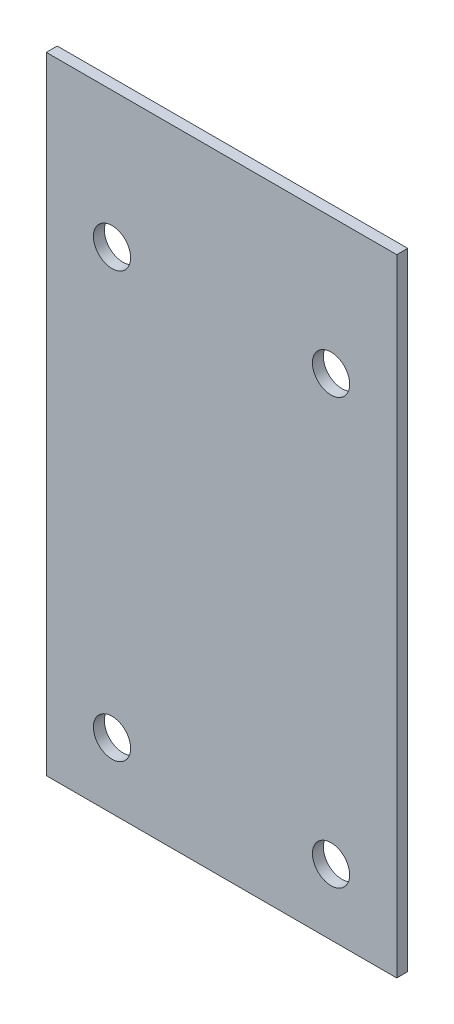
ISO-10303-21;
HEADER;
FILE_DESCRIPTION(('STEP AP214'),'2;1');
FILE_NAME('part.step','',(''),(''),'','','');
FILE_SCHEMA(('AUTOMOTIVE_DESIGN { 1 0 10303 214 1 1 1 1 }'));
ENDSEC;
DATA;
#1=APPLICATION_CONTEXT('core data for automotive mechanical design processes');
#2=APPLICATION_PROTOCOL_DEFINITION('international standard','automotive_design',2000,#1);
#3=PRODUCT_CONTEXT('',#1,'mechanical');
#4=PRODUCT('Part','Part','',(#3));
#5=PRODUCT_RELATED_PRODUCT_CATEGORY('part','',(#4));
#6=PRODUCT_DEFINITION_FORMATION('','',#4);
#7=PRODUCT_DEFINITION_CONTEXT('part definition',#1,'design');
#8=PRODUCT_DEFINITION('design','',#6,#7);
#9=PRODUCT_DEFINITION_SHAPE('','',#8);
#10=(LENGTH_UNIT() NAMED_UNIT(*) SI_UNIT(.MILLI.,.METRE.));
#11=(NAMED_UNIT(*) PLANE_ANGLE_UNIT() SI_UNIT($,.RADIAN.));
#12=(NAMED_UNIT(*) SI_UNIT($,.STERADIAN.) SOLID_ANGLE_UNIT());
#13=UNCERTAINTY_MEASURE_WITH_UNIT(LENGTH_MEASURE(1.E-05),#10,'distance_accuracy_value','');
#14=(GEOMETRIC_REPRESENTATION_CONTEXT(3) GLOBAL_UNCERTAINTY_ASSIGNED_CONTEXT((#13)) GLOBAL_UNIT_ASSIGNED_CONTEXT((#10,
#11,#12)) REPRESENTATION_CONTEXT('',''));
#15=CARTESIAN_POINT('',(0.,0.,0.));
#16=DIRECTION('',(0.,0.,1.));
#17=DIRECTION('',(1.,0.,0.));
#18=AXIS2_PLACEMENT_3D('',#15,#16,#17);
#19=CARTESIAN_POINT('',(40.,143.,2.5));
#20=DIRECTION('',(0.,0.,-1.));
#21=DIRECTION('',(0.,1.,0.));
#22=AXIS2_PLACEMENT_3D('',#19,#20,#21);
#23=PLANE('',#22);
#24=CARTESIAN_POINT('',(25.,112.,2.5));
#25=DIRECTION('',(0.,0.,-1.));
#26=DIRECTION('',(0.,1.,0.));
#27=AXIS2_PLACEMENT_3D('',#24,#25,#26);
#28=CIRCLE('',#27,4.25);
#29=CARTESIAN_POINT('',(25.,116.25,2.5));
#30=VERTEX_POINT('',#29);
#31=EDGE_CURVE('E133',#30,#30,#28,.T.);
#32=ORIENTED_EDGE('',*,*,#31,.T.);
#33=EDGE_LOOP('',(#32));
#34=FACE_BOUND('',#33,.T.);
#35=CARTESIAN_POINT('',(-25.,112.,2.5));
#36=DIRECTION('',(0.,0.,-1.));
#37=DIRECTION('',(0.,1.,0.));
#38=AXIS2_PLACEMENT_3D('',#35,#36,#37);
#39=CIRCLE('',#38,4.25);
#40=CARTESIAN_POINT('',(-25.,116.25,2.5));
#41=VERTEX_POINT('',#40);
#42=EDGE_CURVE('E126',#41,#41,#39,.T.);
#43=ORIENTED_EDGE('',*,*,#42,.T.);
#44=EDGE_LOOP('',(#43));
#45=FACE_BOUND('',#44,.T.);
#46=CARTESIAN_POINT('',(25.,15.,2.5));
#47=DIRECTION('',(0.,0.,-1.));
#48=DIRECTION('',(0.,1.,0.));
#49=AXIS2_PLACEMENT_3D('',#46,#47,#48);
#50=CIRCLE('',#49,4.25);
#51=CARTESIAN_POINT('',(25.,19.25,2.5));
#52=VERTEX_POINT('',#51);
#53=EDGE_CURVE('E140',#52,#52,#50,.T.);
#54=ORIENTED_EDGE('',*,*,#53,.T.);
#55=EDGE_LOOP('',(#54));
#56=FACE_BOUND('',#55,.T.);
#57=CARTESIAN_POINT('',(-25.,15.,2.5));
#58=DIRECTION('',(0.,0.,-1.));
#59=DIRECTION('',(0.,1.,0.));
#60=AXIS2_PLACEMENT_3D('',#57,#58,#59);
#61=CIRCLE('',#60,4.25);
#62=CARTESIAN_POINT('',(-25.,19.25,2.5));
#63=VERTEX_POINT('',#62);
#64=EDGE_CURVE('E113',#63,#63,#61,.T.);
#65=ORIENTED_EDGE('',*,*,#64,.T.);
#66=EDGE_LOOP('',(#65));
#67=FACE_BOUND('',#66,.T.);
#68=DIRECTION('',(0.,-1.,0.));
#69=VECTOR('',#68,1.);
#70=CARTESIAN_POINT('',(-40.,143.,2.49999999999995));
#71=LINE('',#70,#69);
#72=CARTESIAN_POINT('',(-40.,143.,2.49999999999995));
#73=VERTEX_POINT('',#72);
#74=CARTESIAN_POINT('',(-40.,0.,2.5));
#75=VERTEX_POINT('',#74);
#76=EDGE_CURVE('E110',#73,#75,#71,.T.);
#77=ORIENTED_EDGE('',*,*,#76,.T.);
#78=DIRECTION('',(-1.,0.,0.));
#79=VECTOR('',#78,1.);
#80=CARTESIAN_POINT('',(40.,0.,2.5));
#81=LINE('',#80,#79);
#82=CARTESIAN_POINT('',(40.,0.,2.5));
#83=VERTEX_POINT('',#82);
#84=EDGE_CURVE('E11',#83,#75,#81,.T.);
#85=ORIENTED_EDGE('',*,*,#84,.F.);
#86=DIRECTION('',(0.,-1.,0.));
#87=VECTOR('',#86,1.);
#88=CARTESIAN_POINT('',(40.,143.,2.5));
#89=LINE('',#88,#87);
#90=CARTESIAN_POINT('',(40.,143.,2.5));
#91=VERTEX_POINT('',#90);
#92=EDGE_CURVE('E81',#91,#83,#89,.T.);
#93=ORIENTED_EDGE('',*,*,#92,.F.);
#94=DIRECTION('',(-1.,0.,0.));
#95=VECTOR('',#94,1.);
#96=CARTESIAN_POINT('',(40.,143.,2.5));
#97=LINE('',#96,#95);
#98=EDGE_CURVE('E57',#91,#73,#97,.T.);
#99=ORIENTED_EDGE('',*,*,#98,.T.);
#100=EDGE_LOOP('',(#77,#85,#93,#99));
#101=FACE_BOUND('',#100,.T.);
#102=ADVANCED_FACE('F40',(#34,#45,#56,#67,#101),#23,.F.);
#103=CARTESIAN_POINT('',(40.,0.,0.));
#104=DIRECTION('',(0.,-1.,0.));
#105=DIRECTION('',(0.,0.,-1.));
#106=AXIS2_PLACEMENT_3D('',#103,#104,#105);
#107=PLANE('',#106);
#108=DIRECTION('',(0.,0.,1.));
#109=VECTOR('',#108,1.);
#110=CARTESIAN_POINT('',(-39.9999999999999,0.,0.));
#111=LINE('',#110,#109);
#112=CARTESIAN_POINT('',(-39.9999999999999,0.,0.));
#113=VERTEX_POINT('',#112);
#114=EDGE_CURVE('E90',#113,#75,#111,.T.);
#115=ORIENTED_EDGE('',*,*,#114,.F.);
#116=DIRECTION('',(-1.,0.,0.));
#117=VECTOR('',#116,1.);
#118=CARTESIAN_POINT('',(40.,0.,0.));
#119=LINE('',#118,#117);
#120=CARTESIAN_POINT('',(40.,0.,0.));
#121=VERTEX_POINT('',#120);
#122=EDGE_CURVE('E49',#121,#113,#119,.T.);
#123=ORIENTED_EDGE('',*,*,#122,.F.);
#124=DIRECTION('',(0.,0.,1.));
#125=VECTOR('',#124,1.);
#126=CARTESIAN_POINT('',(40.,0.,0.));
#127=LINE('',#126,#125);
#128=EDGE_CURVE('E88',#121,#83,#127,.T.);
#129=ORIENTED_EDGE('',*,*,#128,.T.);
#130=ORIENTED_EDGE('',*,*,#84,.T.);
#131=EDGE_LOOP('',(#115,#123,#129,#130));
#132=FACE_BOUND('',#131,.T.);
#133=ADVANCED_FACE('F87',(#132),#107,.T.);
#134=CARTESIAN_POINT('',(40.,143.,0.));
#135=DIRECTION('',(0.,0.,-1.));
#136=DIRECTION('',(0.,1.,0.));
#137=AXIS2_PLACEMENT_3D('',#134,#135,#136);
#138=PLANE('',#137);
#139=CARTESIAN_POINT('',(25.,112.,0.));
#140=DIRECTION('',(0.,0.,-1.));
#141=DIRECTION('',(0.,1.,0.));
#142=AXIS2_PLACEMENT_3D('',#139,#140,#141);
#143=CIRCLE('',#142,4.25);
#144=CARTESIAN_POINT('',(25.,116.25,0.));
#145=VERTEX_POINT('',#144);
#146=EDGE_CURVE('E143',#145,#145,#143,.T.);
#147=ORIENTED_EDGE('',*,*,#146,.F.);
#148=EDGE_LOOP('',(#147));
#149=FACE_BOUND('',#148,.T.);
#150=CARTESIAN_POINT('',(-25.,112.,0.));
#151=DIRECTION('',(0.,0.,-1.));
#152=DIRECTION('',(0.,1.,0.));
#153=AXIS2_PLACEMENT_3D('',#150,#151,#152);
#154=CIRCLE('',#153,4.25);
#155=CARTESIAN_POINT('',(-25.,116.25,0.));
#156=VERTEX_POINT('',#155);
#157=EDGE_CURVE('E129',#156,#156,#154,.T.);
#158=ORIENTED_EDGE('',*,*,#157,.F.);
#159=EDGE_LOOP('',(#158));
#160=FACE_BOUND('',#159,.T.);
#161=CARTESIAN_POINT('',(25.,15.,0.));
#162=DIRECTION('',(0.,0.,-1.));
#163=DIRECTION('',(0.,1.,0.));
#164=AXIS2_PLACEMENT_3D('',#161,#162,#163);
#165=CIRCLE('',#164,4.25);
#166=CARTESIAN_POINT('',(25.,19.25,0.));
#167=VERTEX_POINT('',#166);
#168=EDGE_CURVE('E128',#167,#167,#165,.T.);
#169=ORIENTED_EDGE('',*,*,#168,.F.);
#170=EDGE_LOOP('',(#169));
#171=FACE_BOUND('',#170,.T.);
#172=CARTESIAN_POINT('',(-25.,15.,0.));
#173=DIRECTION('',(0.,0.,-1.));
#174=DIRECTION('',(0.,1.,0.));
#175=AXIS2_PLACEMENT_3D('',#172,#173,#174);
#176=CIRCLE('',#175,4.25);
#177=CARTESIAN_POINT('',(-25.,19.25,0.));
#178=VERTEX_POINT('',#177);
#179=EDGE_CURVE('E137',#178,#178,#176,.T.);
#180=ORIENTED_EDGE('',*,*,#179,.F.);
#181=EDGE_LOOP('',(#180));
#182=FACE_BOUND('',#181,.T.);
#183=DIRECTION('',(0.,-1.,0.));
#184=VECTOR('',#183,1.);
#185=CARTESIAN_POINT('',(-40.,143.,0.));
#186=LINE('',#185,#184);
#187=CARTESIAN_POINT('',(-40.,143.,0.));
#188=VERTEX_POINT('',#187);
#189=EDGE_CURVE('E115',#188,#113,#186,.T.);
#190=ORIENTED_EDGE('',*,*,#189,.F.);
#191=DIRECTION('',(-1.,0.,0.));
#192=VECTOR('',#191,1.);
#193=CARTESIAN_POINT('',(40.,143.,0.));
#194=LINE('',#193,#192);
#195=CARTESIAN_POINT('',(40.,143.,0.));
#196=VERTEX_POINT('',#195);
#197=EDGE_CURVE('E70',#196,#188,#194,.T.);
#198=ORIENTED_EDGE('',*,*,#197,.F.);
#199=DIRECTION('',(0.,-1.,0.));
#200=VECTOR('',#199,1.);
#201=CARTESIAN_POINT('',(40.,143.,0.));
#202=LINE('',#201,#200);
#203=EDGE_CURVE('E97',#196,#121,#202,.T.);
#204=ORIENTED_EDGE('',*,*,#203,.T.);
#205=ORIENTED_EDGE('',*,*,#122,.T.);
#206=EDGE_LOOP('',(#190,#198,#204,#205));
#207=FACE_BOUND('',#206,.T.);
#208=ADVANCED_FACE('F100',(#149,#160,#171,#182,#207),#138,.T.);
#209=CARTESIAN_POINT('',(40.,143.,2.5));
#210=DIRECTION('',(0.,1.,0.));
#211=DIRECTION('',(0.,0.,1.));
#212=AXIS2_PLACEMENT_3D('',#209,#210,#211);
#213=PLANE('',#212);
#214=DIRECTION('',(0.,0.,-1.));
#215=VECTOR('',#214,1.);
#216=CARTESIAN_POINT('',(-40.,143.,2.49999999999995));
#217=LINE('',#216,#215);
#218=EDGE_CURVE('E118',#73,#188,#217,.T.);
#219=ORIENTED_EDGE('',*,*,#218,.F.);
#220=ORIENTED_EDGE('',*,*,#98,.F.);
#221=DIRECTION('',(0.,0.,-1.));
#222=VECTOR('',#221,1.);
#223=CARTESIAN_POINT('',(40.,143.,2.5));
#224=LINE('',#223,#222);
#225=EDGE_CURVE('E102',#91,#196,#224,.T.);
#226=ORIENTED_EDGE('',*,*,#225,.T.);
#227=ORIENTED_EDGE('',*,*,#197,.T.);
#228=EDGE_LOOP('',(#219,#220,#226,#227));
#229=FACE_BOUND('',#228,.T.);
#230=ADVANCED_FACE('F190',(#229),#213,.T.);
#231=CARTESIAN_POINT('',(40.,0.,2.5));
#232=DIRECTION('',(-1.,0.,0.));
#233=DIRECTION('',(0.,0.,1.));
#234=AXIS2_PLACEMENT_3D('',#231,#232,#233);
#235=PLANE('',#234);
#236=ORIENTED_EDGE('',*,*,#92,.T.);
#237=ORIENTED_EDGE('',*,*,#128,.F.);
#238=ORIENTED_EDGE('',*,*,#203,.F.);
#239=ORIENTED_EDGE('',*,*,#225,.F.);
#240=EDGE_LOOP('',(#236,#237,#238,#239));
#241=FACE_BOUND('',#240,.T.);
#242=ADVANCED_FACE('F96',(#241),#235,.F.);
#243=CARTESIAN_POINT('',(-40.,0.,2.5));
#244=DIRECTION('',(-1.,0.,0.));
#245=DIRECTION('',(0.,0.,1.));
#246=AXIS2_PLACEMENT_3D('',#243,#244,#245);
#247=PLANE('',#246);
#248=ORIENTED_EDGE('',*,*,#76,.F.);
#249=ORIENTED_EDGE('',*,*,#218,.T.);
#250=ORIENTED_EDGE('',*,*,#189,.T.);
#251=ORIENTED_EDGE('',*,*,#114,.T.);
#252=EDGE_LOOP('',(#248,#249,#250,#251));
#253=FACE_BOUND('',#252,.T.);
#254=ADVANCED_FACE('F174',(#253),#247,.T.);
#255=CARTESIAN_POINT('',(-25.,15.,0.));
#256=DIRECTION('',(0.,0.,-1.));
#257=DIRECTION('',(0.,1.,0.));
#258=AXIS2_PLACEMENT_3D('',#255,#256,#257);
#259=CYLINDRICAL_SURFACE('',#258,4.25);
#260=ORIENTED_EDGE('',*,*,#64,.F.);
#261=EDGE_LOOP('',(#260));
#262=FACE_BOUND('',#261,.T.);
#263=ORIENTED_EDGE('',*,*,#179,.T.);
#264=EDGE_LOOP('',(#263));
#265=FACE_BOUND('',#264,.T.);
#266=ADVANCED_FACE('F165',(#262,#265),#259,.F.);
#267=CARTESIAN_POINT('',(25.,15.,0.));
#268=DIRECTION('',(0.,0.,-1.));
#269=DIRECTION('',(0.,1.,0.));
#270=AXIS2_PLACEMENT_3D('',#267,#268,#269);
#271=CYLINDRICAL_SURFACE('',#270,4.25);
#272=ORIENTED_EDGE('',*,*,#53,.F.);
#273=EDGE_LOOP('',(#272));
#274=FACE_BOUND('',#273,.T.);
#275=ORIENTED_EDGE('',*,*,#168,.T.);
#276=EDGE_LOOP('',(#275));
#277=FACE_BOUND('',#276,.T.);
#278=ADVANCED_FACE('F162',(#274,#277),#271,.F.);
#279=CARTESIAN_POINT('',(-25.,112.,0.));
#280=DIRECTION('',(0.,0.,-1.));
#281=DIRECTION('',(0.,1.,0.));
#282=AXIS2_PLACEMENT_3D('',#279,#280,#281);
#283=CYLINDRICAL_SURFACE('',#282,4.25);
#284=ORIENTED_EDGE('',*,*,#42,.F.);
#285=EDGE_LOOP('',(#284));
#286=FACE_BOUND('',#285,.T.);
#287=ORIENTED_EDGE('',*,*,#157,.T.);
#288=EDGE_LOOP('',(#287));
#289=FACE_BOUND('',#288,.T.);
#290=ADVANCED_FACE('F164',(#286,#289),#283,.F.);
#291=CARTESIAN_POINT('',(25.,112.,0.));
#292=DIRECTION('',(0.,0.,-1.));
#293=DIRECTION('',(0.,1.,0.));
#294=AXIS2_PLACEMENT_3D('',#291,#292,#293);
#295=CYLINDRICAL_SURFACE('',#294,4.25);
#296=ORIENTED_EDGE('',*,*,#31,.F.);
#297=EDGE_LOOP('',(#296));
#298=FACE_BOUND('',#297,.T.);
#299=ORIENTED_EDGE('',*,*,#146,.T.);
#300=EDGE_LOOP('',(#299));
#301=FACE_BOUND('',#300,.T.);
#302=ADVANCED_FACE('F171',(#298,#301),#295,.F.);
#303=CLOSED_SHELL('',(#102,#133,#208,#230,#242,#254,#266,#278,#290,#302));
#304=MANIFOLD_SOLID_BREP('B2',#303);
#305=ADVANCED_BREP_SHAPE_REPRESENTATION('',(#18,#304),#14);
#306=SHAPE_DEFINITION_REPRESENTATION(#9,#305);
ENDSEC;
END-ISO-10303-21;
